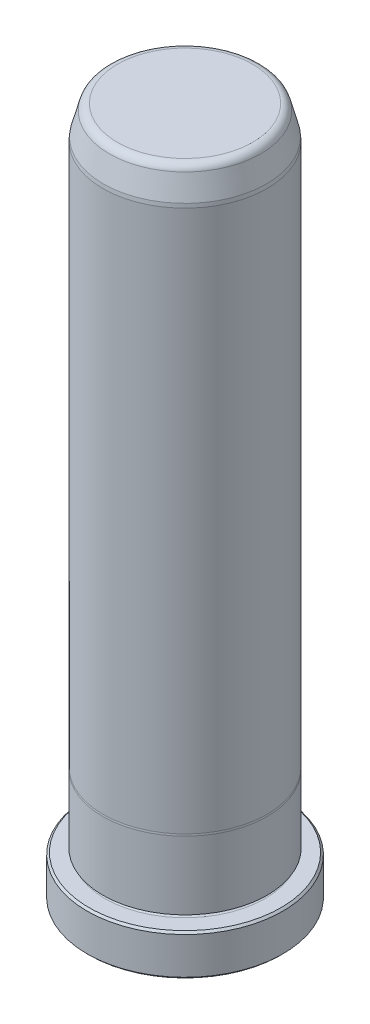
ISO-10303-21;
HEADER;
FILE_DESCRIPTION(('STEP AP214'),'2;1');
FILE_NAME('part.step','',(''),(''),'','','');
FILE_SCHEMA(('AUTOMOTIVE_DESIGN { 1 0 10303 214 1 1 1 1 }'));
ENDSEC;
DATA;
#1=APPLICATION_CONTEXT('core data for automotive mechanical design processes');
#2=APPLICATION_PROTOCOL_DEFINITION('international standard','automotive_design',2000,#1);
#3=PRODUCT_CONTEXT('',#1,'mechanical');
#4=PRODUCT('Part','Part','',(#3));
#5=PRODUCT_RELATED_PRODUCT_CATEGORY('part','',(#4));
#6=PRODUCT_DEFINITION_FORMATION('','',#4);
#7=PRODUCT_DEFINITION_CONTEXT('part definition',#1,'design');
#8=PRODUCT_DEFINITION('design','',#6,#7);
#9=PRODUCT_DEFINITION_SHAPE('','',#8);
#10=(LENGTH_UNIT() NAMED_UNIT(*) SI_UNIT(.MILLI.,.METRE.));
#11=(NAMED_UNIT(*) PLANE_ANGLE_UNIT() SI_UNIT($,.RADIAN.));
#12=(NAMED_UNIT(*) SI_UNIT($,.STERADIAN.) SOLID_ANGLE_UNIT());
#13=UNCERTAINTY_MEASURE_WITH_UNIT(LENGTH_MEASURE(1.E-05),#10,'distance_accuracy_value','');
#14=(GEOMETRIC_REPRESENTATION_CONTEXT(3) GLOBAL_UNCERTAINTY_ASSIGNED_CONTEXT((#13)) GLOBAL_UNIT_ASSIGNED_CONTEXT((#10,
#11,#12)) REPRESENTATION_CONTEXT('',''));
#15=CARTESIAN_POINT('',(0.,0.,0.));
#16=DIRECTION('',(0.,0.,1.));
#17=DIRECTION('',(1.,0.,0.));
#18=AXIS2_PLACEMENT_3D('',#15,#16,#17);
#19=CARTESIAN_POINT('',(0.,0.,0.));
#20=DIRECTION('',(0.,1.,0.));
#21=DIRECTION('',(0.,0.,1.));
#22=AXIS2_PLACEMENT_3D('',#19,#20,#21);
#23=PLANE('',#22);
#24=CARTESIAN_POINT('',(0.,0.,0.));
#25=DIRECTION('',(0.,1.,0.));
#26=DIRECTION('',(0.,0.,1.));
#27=AXIS2_PLACEMENT_3D('',#24,#25,#26);
#28=CIRCLE('',#27,18.5420000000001);
#29=CARTESIAN_POINT('',(0.,-2.92734586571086E-13,18.5420000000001));
#30=VERTEX_POINT('',#29);
#31=EDGE_CURVE('E37',#30,#30,#28,.F.);
#32=ORIENTED_EDGE('',*,*,#31,.T.);
#33=EDGE_LOOP('',(#32));
#34=FACE_BOUND('',#33,.T.);
#35=ADVANCED_FACE('F30',(#34),#23,.F.);
#36=CARTESIAN_POINT('',(0.,0.,0.));
#37=DIRECTION('',(0.,1.,0.));
#38=DIRECTION('',(0.,0.,1.));
#39=AXIS2_PLACEMENT_3D('',#36,#37,#38);
#40=CYLINDRICAL_SURFACE('',#39,18.923);
#41=CARTESIAN_POINT('',(0.,0.380999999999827,0.));
#42=DIRECTION('',(0.,1.,0.));
#43=DIRECTION('',(0.,0.,1.));
#44=AXIS2_PLACEMENT_3D('',#41,#42,#43);
#45=CIRCLE('',#44,18.923);
#46=CARTESIAN_POINT('',(0.,0.380999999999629,18.923));
#47=VERTEX_POINT('',#46);
#48=EDGE_CURVE('E41',#47,#47,#45,.T.);
#49=ORIENTED_EDGE('',*,*,#48,.T.);
#50=EDGE_LOOP('',(#49));
#51=FACE_BOUND('',#50,.T.);
#52=CARTESIAN_POINT('',(0.,7.54379999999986,0.));
#53=DIRECTION('',(0.,-1.,0.));
#54=DIRECTION('',(0.,0.,-1.));
#55=AXIS2_PLACEMENT_3D('',#52,#53,#54);
#56=CIRCLE('',#55,18.923);
#57=CARTESIAN_POINT('',(0.,7.54380000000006,-18.923));
#58=VERTEX_POINT('',#57);
#59=EDGE_CURVE('E45',#58,#58,#56,.T.);
#60=ORIENTED_EDGE('',*,*,#59,.T.);
#61=EDGE_LOOP('',(#60));
#62=FACE_BOUND('',#61,.T.);
#63=ADVANCED_FACE('F118',(#51,#62),#40,.T.);
#64=CARTESIAN_POINT('',(0.,7.92480000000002,-18.923));
#65=DIRECTION('',(0.,-1.,0.));
#66=DIRECTION('',(0.,0.,-1.));
#67=AXIS2_PLACEMENT_3D('',#64,#65,#66);
#68=PLANE('',#67);
#69=CARTESIAN_POINT('',(0.,7.92479999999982,0.));
#70=DIRECTION('',(0.,-1.,0.));
#71=DIRECTION('',(0.,0.,-1.));
#72=AXIS2_PLACEMENT_3D('',#69,#70,#71);
#73=CIRCLE('',#72,18.5420000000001);
#74=CARTESIAN_POINT('',(0.,7.92480000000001,-18.542));
#75=VERTEX_POINT('',#74);
#76=EDGE_CURVE('E10',#75,#75,#73,.F.);
#77=ORIENTED_EDGE('',*,*,#76,.T.);
#78=EDGE_LOOP('',(#77));
#79=FACE_BOUND('',#78,.T.);
#80=CARTESIAN_POINT('',(0.,7.92479999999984,0.));
#81=DIRECTION('',(0.,1.,0.));
#82=DIRECTION('',(0.,0.,1.));
#83=AXIS2_PLACEMENT_3D('',#80,#81,#82);
#84=CIRCLE('',#83,15.4813000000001);
#85=CARTESIAN_POINT('',(0.,7.92479999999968,15.4813000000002));
#86=VERTEX_POINT('',#85);
#87=EDGE_CURVE('E56',#86,#86,#84,.T.);
#88=ORIENTED_EDGE('',*,*,#87,.F.);
#89=EDGE_LOOP('',(#88));
#90=FACE_BOUND('',#89,.T.);
#91=ADVANCED_FACE('F113',(#79,#90),#68,.F.);
#92=CARTESIAN_POINT('',(0.,8.30579999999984,0.));
#93=DIRECTION('',(0.,1.,0.));
#94=DIRECTION('',(0.,0.,1.));
#95=AXIS2_PLACEMENT_3D('',#92,#93,#94);
#96=TOROIDAL_SURFACE('',#95,15.4813000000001,0.381);
#97=CARTESIAN_POINT('',(0.,8.68679999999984,0.));
#98=DIRECTION('',(0.,1.,0.));
#99=DIRECTION('',(0.,0.,1.));
#100=AXIS2_PLACEMENT_3D('',#97,#98,#99);
#101=CIRCLE('',#100,15.4813000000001);
#102=CARTESIAN_POINT('',(0.,8.68679999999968,15.4813000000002));
#103=VERTEX_POINT('',#102);
#104=EDGE_CURVE('E59',#103,#103,#101,.T.);
#105=ORIENTED_EDGE('',*,*,#104,.F.);
#106=EDGE_LOOP('',(#105));
#107=FACE_BOUND('',#106,.T.);
#108=ORIENTED_EDGE('',*,*,#87,.T.);
#109=EDGE_LOOP('',(#108));
#110=FACE_BOUND('',#109,.T.);
#111=ADVANCED_FACE('F107',(#107,#110),#96,.F.);
#112=CARTESIAN_POINT('',(0.,8.6868,-15.4813));
#113=DIRECTION('',(0.,1.,0.));
#114=DIRECTION('',(0.,0.,1.));
#115=AXIS2_PLACEMENT_3D('',#112,#113,#114);
#116=PLANE('',#115);
#117=CARTESIAN_POINT('',(0.,8.68679999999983,0.));
#118=DIRECTION('',(0.,1.,0.));
#119=DIRECTION('',(0.,0.,1.));
#120=AXIS2_PLACEMENT_3D('',#117,#118,#119);
#121=CIRCLE('',#120,15.8877000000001);
#122=CARTESIAN_POINT('',(0.,8.68679999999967,15.8877000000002));
#123=VERTEX_POINT('',#122);
#124=EDGE_CURVE('E62',#123,#123,#121,.T.);
#125=ORIENTED_EDGE('',*,*,#124,.F.);
#126=EDGE_LOOP('',(#125));
#127=FACE_BOUND('',#126,.T.);
#128=ORIENTED_EDGE('',*,*,#104,.T.);
#129=EDGE_LOOP('',(#128));
#130=FACE_BOUND('',#129,.T.);
#131=ADVANCED_FACE('F101',(#127,#130),#116,.F.);
#132=CARTESIAN_POINT('',(0.,0.,0.));
#133=DIRECTION('',(0.,1.,0.));
#134=DIRECTION('',(0.,0.,1.));
#135=AXIS2_PLACEMENT_3D('',#132,#133,#134);
#136=CYLINDRICAL_SURFACE('',#135,15.8877000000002);
#137=CARTESIAN_POINT('',(0.,21.8617630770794,2.28526874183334E-13));
#138=DIRECTION('',(0.,1.,0.));
#139=DIRECTION('',(0.,0.,1.));
#140=AXIS2_PLACEMENT_3D('',#137,#138,#139);
#141=CIRCLE('',#140,15.8877000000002);
#142=CARTESIAN_POINT('',(0.,21.8617630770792,15.8877000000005));
#143=VERTEX_POINT('',#142);
#144=EDGE_CURVE('E65',#143,#143,#141,.T.);
#145=ORIENTED_EDGE('',*,*,#144,.F.);
#146=EDGE_LOOP('',(#145));
#147=FACE_BOUND('',#146,.T.);
#148=ORIENTED_EDGE('',*,*,#124,.T.);
#149=EDGE_LOOP('',(#148));
#150=FACE_BOUND('',#149,.T.);
#151=ADVANCED_FACE('F95',(#147,#150),#136,.T.);
#152=CARTESIAN_POINT('',(0.,21.8617630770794,2.28526874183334E-13));
#153=DIRECTION('',(0.,-1.,0.));
#154=DIRECTION('',(0.,0.,-1.));
#155=AXIS2_PLACEMENT_3D('',#152,#153,#154);
#156=CONICAL_SURFACE('',#155,15.8877000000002,0.0698131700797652);
#157=CARTESIAN_POINT('',(0.,22.2249999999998,2.32323887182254E-13));
#158=DIRECTION('',(0.,1.,0.));
#159=DIRECTION('',(0.,0.,1.));
#160=AXIS2_PLACEMENT_3D('',#157,#158,#159);
#161=CIRCLE('',#160,15.8623000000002);
#162=CARTESIAN_POINT('',(0.,22.2249999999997,15.8623000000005));
#163=VERTEX_POINT('',#162);
#164=EDGE_CURVE('E68',#163,#163,#161,.T.);
#165=ORIENTED_EDGE('',*,*,#164,.F.);
#166=EDGE_LOOP('',(#165));
#167=FACE_BOUND('',#166,.T.);
#168=ORIENTED_EDGE('',*,*,#144,.T.);
#169=EDGE_LOOP('',(#168));
#170=FACE_BOUND('',#169,.T.);
#171=ADVANCED_FACE('F89',(#167,#170),#156,.T.);
#172=CARTESIAN_POINT('',(0.,0.,0.));
#173=DIRECTION('',(0.,1.,0.));
#174=DIRECTION('',(0.,0.,1.));
#175=AXIS2_PLACEMENT_3D('',#172,#173,#174);
#176=CYLINDRICAL_SURFACE('',#175,15.8623000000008);
#177=CARTESIAN_POINT('',(0.,127.,1.32756506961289E-12));
#178=DIRECTION('',(0.,1.,0.));
#179=DIRECTION('',(0.,0.,1.));
#180=AXIS2_PLACEMENT_3D('',#177,#178,#179);
#181=CIRCLE('',#180,15.8623000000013);
#182=CARTESIAN_POINT('',(0.,127.,15.8623000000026));
#183=VERTEX_POINT('',#182);
#184=EDGE_CURVE('E71',#183,#183,#181,.T.);
#185=ORIENTED_EDGE('',*,*,#184,.F.);
#186=EDGE_LOOP('',(#185));
#187=FACE_BOUND('',#186,.T.);
#188=ORIENTED_EDGE('',*,*,#164,.T.);
#189=EDGE_LOOP('',(#188));
#190=FACE_BOUND('',#189,.T.);
#191=ADVANCED_FACE('F83',(#187,#190),#176,.T.);
#192=CARTESIAN_POINT('',(0.,127.,1.32756506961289E-12));
#193=DIRECTION('',(0.,-1.,0.));
#194=DIRECTION('',(0.,0.,-1.));
#195=AXIS2_PLACEMENT_3D('',#192,#193,#194);
#196=CONICAL_SURFACE('',#195,15.8623000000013,0.0872664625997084);
#197=CARTESIAN_POINT('',(0.,127.762,1.33553046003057E-12));
#198=DIRECTION('',(0.,1.,0.));
#199=DIRECTION('',(0.,0.,1.));
#200=AXIS2_PLACEMENT_3D('',#197,#198,#199);
#201=CIRCLE('',#200,15.7956336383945);
#202=CARTESIAN_POINT('',(0.,127.762,15.7956336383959));
#203=VERTEX_POINT('',#202);
#204=EDGE_CURVE('E74',#203,#203,#201,.T.);
#205=ORIENTED_EDGE('',*,*,#204,.F.);
#206=EDGE_LOOP('',(#205));
#207=FACE_BOUND('',#206,.T.);
#208=ORIENTED_EDGE('',*,*,#184,.T.);
#209=EDGE_LOOP('',(#208));
#210=FACE_BOUND('',#209,.T.);
#211=ADVANCED_FACE('F80',(#207,#210),#196,.T.);
#212=CARTESIAN_POINT('',(0.,127.762,1.33553046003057E-12));
#213=DIRECTION('',(0.,-1.,0.));
#214=DIRECTION('',(0.,0.,-1.));
#215=AXIS2_PLACEMENT_3D('',#212,#213,#214);
#216=CONICAL_SURFACE('',#215,15.7956336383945,0.26179938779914);
#217=CARTESIAN_POINT('',(0.,132.1733752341,1.38164374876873E-12));
#218=DIRECTION('',(0.,1.,0.));
#219=DIRECTION('',(0.,0.,1.));
#220=AXIS2_PLACEMENT_3D('',#217,#218,#219);
#221=CIRCLE('',#220,14.6136092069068);
#222=CARTESIAN_POINT('',(0.,132.1733752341,14.6136092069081));
#223=VERTEX_POINT('',#222);
#224=EDGE_CURVE('E50',#223,#223,#221,.F.);
#225=ORIENTED_EDGE('',*,*,#224,.T.);
#226=EDGE_LOOP('',(#225));
#227=FACE_BOUND('',#226,.T.);
#228=ORIENTED_EDGE('',*,*,#204,.T.);
#229=EDGE_LOOP('',(#228));
#230=FACE_BOUND('',#229,.T.);
#231=ADVANCED_FACE('F78',(#227,#230),#216,.T.);
#232=CARTESIAN_POINT('',(0.,133.35,-14.2983335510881));
#233=DIRECTION('',(0.,-1.,0.));
#234=DIRECTION('',(0.,0.,-1.));
#235=AXIS2_PLACEMENT_3D('',#232,#233,#234);
#236=PLANE('',#235);
#237=CARTESIAN_POINT('',(0.,133.35,1.39394332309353E-12));
#238=DIRECTION('',(0.,-1.,0.));
#239=DIRECTION('',(0.,0.,-1.));
#240=AXIS2_PLACEMENT_3D('',#237,#238,#239);
#241=CIRCLE('',#240,13.0802019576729);
#242=CARTESIAN_POINT('',(0.,133.35,-13.0802019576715));
#243=VERTEX_POINT('',#242);
#244=EDGE_CURVE('E53',#243,#243,#241,.F.);
#245=ORIENTED_EDGE('',*,*,#244,.T.);
#246=EDGE_LOOP('',(#245));
#247=FACE_BOUND('',#246,.T.);
#248=ADVANCED_FACE('F133',(#247),#236,.F.);
#249=CARTESIAN_POINT('',(0.,131.7625,1.37734875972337E-12));
#250=DIRECTION('',(0.,-1.,0.));
#251=DIRECTION('',(0.,0.,-1.));
#252=AXIS2_PLACEMENT_3D('',#249,#250,#251);
#253=TOROIDAL_SURFACE('',#252,13.0802019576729,1.5875);
#254=ORIENTED_EDGE('',*,*,#224,.F.);
#255=EDGE_LOOP('',(#254));
#256=FACE_BOUND('',#255,.T.);
#257=ORIENTED_EDGE('',*,*,#244,.F.);
#258=EDGE_LOOP('',(#257));
#259=FACE_BOUND('',#258,.T.);
#260=ADVANCED_FACE('F130',(#256,#259),#253,.T.);
#261=CARTESIAN_POINT('',(0.,0.380999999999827,0.));
#262=DIRECTION('',(0.,1.,0.));
#263=DIRECTION('',(0.,0.,1.));
#264=AXIS2_PLACEMENT_3D('',#261,#262,#263);
#265=CONICAL_SURFACE('',#264,18.923,0.785398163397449);
#266=CARTESIAN_POINT('',(0.,-2.92734586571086E-13,18.5420000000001));
#267=CARTESIAN_POINT('',(0.,0.00396874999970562,18.5459687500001));
#268=CARTESIAN_POINT('',(0.,0.00793749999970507,18.5499375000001));
#269=CARTESIAN_POINT('',(0.,0.015874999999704,18.5578750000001));
#270=CARTESIAN_POINT('',(0.,0.0198437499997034,18.5618437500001));
#271=CARTESIAN_POINT('',(0.,0.0277812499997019,18.5697812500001));
#272=CARTESIAN_POINT('',(0.,0.0317499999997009,18.5737500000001));
#273=CARTESIAN_POINT('',(0.,0.0396874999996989,18.5816875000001));
#274=CARTESIAN_POINT('',(0.,0.0436562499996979,18.5856562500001));
#275=CARTESIAN_POINT('',(0.,0.0515937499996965,18.5935937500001));
#276=CARTESIAN_POINT('',(0.,0.0555624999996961,18.5975625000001));
#277=CARTESIAN_POINT('',(0.,0.0634999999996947,18.6055000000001));
#278=CARTESIAN_POINT('',(0.,0.0674687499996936,18.6094687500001));
#279=CARTESIAN_POINT('',(0.,0.0754062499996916,18.6174062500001));
#280=CARTESIAN_POINT('',(0.,0.0793749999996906,18.6213750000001));
#281=CARTESIAN_POINT('',(0.,0.0873124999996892,18.6293125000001));
#282=CARTESIAN_POINT('',(0.,0.0912812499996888,18.6332812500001));
#283=CARTESIAN_POINT('',(0.,0.0992187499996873,18.6412187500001));
#284=CARTESIAN_POINT('',(0.,0.103187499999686,18.6451875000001));
#285=CARTESIAN_POINT('',(0.,0.111124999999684,18.6531250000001));
#286=CARTESIAN_POINT('',(0.,0.115093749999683,18.6570937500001));
#287=CARTESIAN_POINT('',(0.,0.123031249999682,18.6650312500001));
#288=CARTESIAN_POINT('',(0.,0.126999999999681,18.6690000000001));
#289=CARTESIAN_POINT('',(0.,0.13493749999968,18.6769375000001));
#290=CARTESIAN_POINT('',(0.,0.138906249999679,18.6809062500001));
#291=CARTESIAN_POINT('',(0.,0.146843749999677,18.6888437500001));
#292=CARTESIAN_POINT('',(0.,0.150812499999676,18.6928125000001));
#293=CARTESIAN_POINT('',(0.,0.158749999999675,18.7007500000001));
#294=CARTESIAN_POINT('',(0.,0.162718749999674,18.7047187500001));
#295=CARTESIAN_POINT('',(0.,0.170656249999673,18.7126562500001));
#296=CARTESIAN_POINT('',(0.,0.174624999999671,18.7166250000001));
#297=CARTESIAN_POINT('',(0.,0.18256249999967,18.7245625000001));
#298=CARTESIAN_POINT('',(0.,0.186531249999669,18.7285312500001));
#299=CARTESIAN_POINT('',(0.,0.194468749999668,18.7364687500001));
#300=CARTESIAN_POINT('',(0.,0.198437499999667,18.7404375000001));
#301=CARTESIAN_POINT('',(0.,0.206374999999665,18.7483750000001));
#302=CARTESIAN_POINT('',(0.,0.210343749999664,18.7523437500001));
#303=CARTESIAN_POINT('',(0.,0.218281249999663,18.7602812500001));
#304=CARTESIAN_POINT('',(0.,0.222249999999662,18.7642500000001));
#305=CARTESIAN_POINT('',(0.,0.23018749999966,18.7721875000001));
#306=CARTESIAN_POINT('',(0.,0.234156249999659,18.7761562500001));
#307=CARTESIAN_POINT('',(0.,0.242093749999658,18.7840937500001));
#308=CARTESIAN_POINT('',(0.,0.246062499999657,18.7880625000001));
#309=CARTESIAN_POINT('',(0.,0.253999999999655,18.7960000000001));
#310=CARTESIAN_POINT('',(0.,0.257968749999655,18.7999687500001));
#311=CARTESIAN_POINT('',(0.,0.265906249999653,18.8079062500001));
#312=CARTESIAN_POINT('',(0.,0.269874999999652,18.8118750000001));
#313=CARTESIAN_POINT('',(0.,0.27781249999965,18.8198125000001));
#314=CARTESIAN_POINT('',(0.,0.281781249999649,18.8237812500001));
#315=CARTESIAN_POINT('',(0.,0.289718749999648,18.8317187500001));
#316=CARTESIAN_POINT('',(0.,0.293687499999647,18.8356875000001));
#317=CARTESIAN_POINT('',(0.,0.301624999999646,18.8436250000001));
#318=CARTESIAN_POINT('',(0.,0.305593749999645,18.8475937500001));
#319=CARTESIAN_POINT('',(0.,0.313531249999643,18.8555312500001));
#320=CARTESIAN_POINT('',(0.,0.317499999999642,18.8595000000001));
#321=CARTESIAN_POINT('',(0.,0.32543749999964,18.8674375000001));
#322=CARTESIAN_POINT('',(0.,0.32940624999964,18.8714062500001));
#323=CARTESIAN_POINT('',(0.,0.337343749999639,18.8793437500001));
#324=CARTESIAN_POINT('',(0.,0.341312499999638,18.8833125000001));
#325=CARTESIAN_POINT('',(0.,0.349249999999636,18.89125));
#326=CARTESIAN_POINT('',(0.,0.353218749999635,18.8952187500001));
#327=CARTESIAN_POINT('',(0.,0.361156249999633,18.90315625));
#328=CARTESIAN_POINT('',(0.,0.365124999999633,18.907125));
#329=CARTESIAN_POINT('',(0.,0.373062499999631,18.9150625));
#330=CARTESIAN_POINT('',(0.,0.377031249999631,18.91903125));
#331=CARTESIAN_POINT('',(0.,0.380999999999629,18.923));
#332=B_SPLINE_CURVE_WITH_KNOTS('',3,(#266,#267,#268,#269,#270,#271,#272,#273,#274,#275,#276,
#277,#278,#279,#280,#281,#282,#283,#284,#285,#286,#287,#288,#289,#290,#291,#292,#293,#294,#295,
#296,#297,#298,#299,#300,#301,#302,#303,#304,#305,#306,#307,#308,#309,#310,#311,#312,#313,#314,
#315,#316,#317,#318,#319,#320,#321,#322,#323,#324,#325,#326,#327,#328,#329,#330,#331),
.UNSPECIFIED.,.F.,.F.,(4,2,2,2,2,2,2,2,2,2,2,2,2,2,2,2,2,2,2,2,2,2,2,2,2,2,2,2,2,2,2,2,4),(0.,
0.0168379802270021,0.0336759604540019,0.050513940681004,0.0673519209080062,0.0841899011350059,
0.101027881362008,0.11786586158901,0.13470384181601,0.151541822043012,0.168379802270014,
0.185217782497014,0.202055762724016,0.218893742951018,0.235731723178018,0.25256970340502,
0.26940768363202,0.286245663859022,0.303083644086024,0.319921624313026,0.336759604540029,
0.353597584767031,0.37043556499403,0.387273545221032,0.404111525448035,0.420949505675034,
0.437787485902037,0.454625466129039,0.471463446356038,0.48830142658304,0.505139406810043,
0.521977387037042,0.538815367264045),.UNSPECIFIED.);
#333=EDGE_CURVE('BSEAM132',#30,#47,#332,.T.);
#334=ORIENTED_EDGE('',*,*,#31,.F.);
#335=ORIENTED_EDGE('',*,*,#48,.F.);
#336=ORIENTED_EDGE('',*,*,#333,.T.);
#337=ORIENTED_EDGE('',*,*,#333,.F.);
#338=EDGE_LOOP('',(#334,#336,#335,#337));
#339=FACE_BOUND('',#338,.T.);
#340=ADVANCED_FACE('F132',(#339),#265,.T.);
#341=CARTESIAN_POINT('',(0.,7.92479999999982,0.));
#342=DIRECTION('',(0.,-1.,0.));
#343=DIRECTION('',(0.,0.,-1.));
#344=AXIS2_PLACEMENT_3D('',#341,#342,#343);
#345=CONICAL_SURFACE('',#344,18.5420000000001,0.785398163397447);
#346=ORIENTED_EDGE('',*,*,#59,.F.);
#347=EDGE_LOOP('',(#346));
#348=FACE_BOUND('',#347,.T.);
#349=ORIENTED_EDGE('',*,*,#76,.F.);
#350=EDGE_LOOP('',(#349));
#351=FACE_BOUND('',#350,.T.);
#352=ADVANCED_FACE('F32',(#348,#351),#345,.T.);
#353=CLOSED_SHELL('',(#35,#63,#91,#111,#131,#151,#171,#191,#211,#231,#248,#260,#340,#352));
#354=MANIFOLD_SOLID_BREP('B2',#353);
#355=ADVANCED_BREP_SHAPE_REPRESENTATION('',(#18,#354),#14);
#356=SHAPE_DEFINITION_REPRESENTATION(#9,#355);
ENDSEC;
END-ISO-10303-21;
